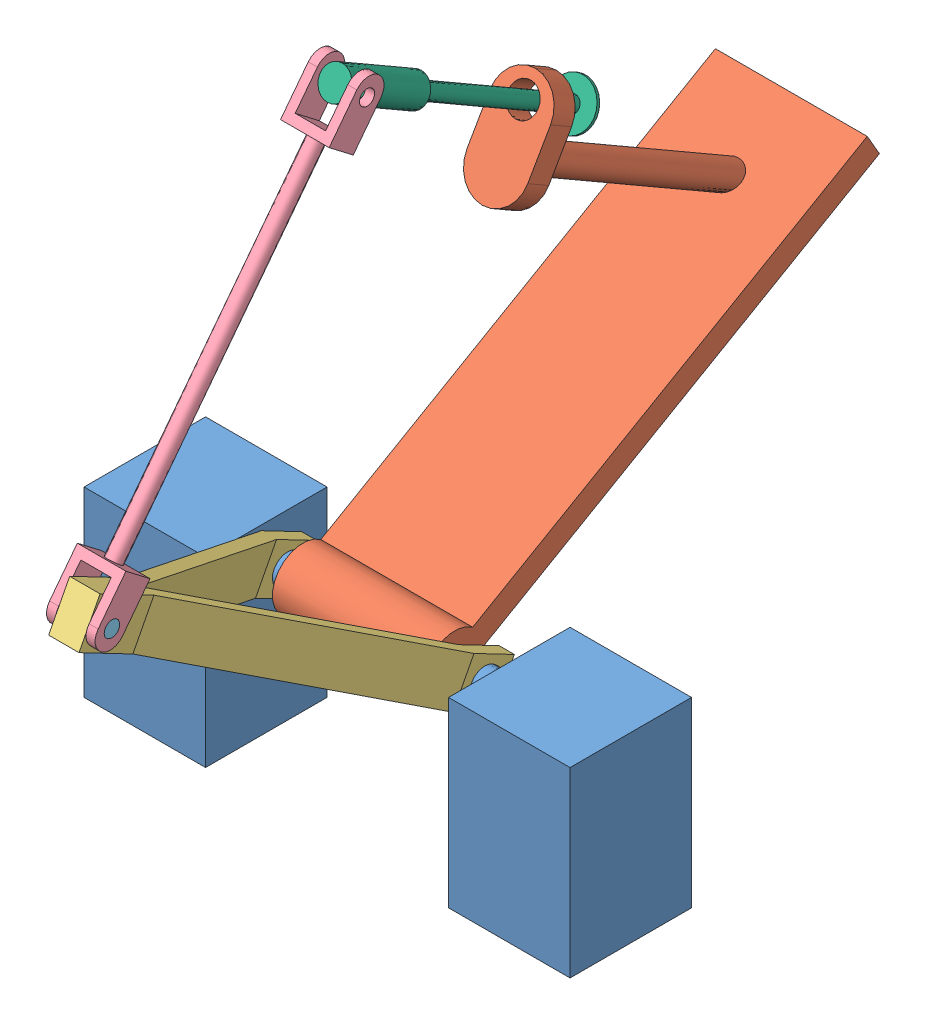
SolidWorks assembly 6.10. Assembl – complete.SLDASM, configuration Default (file format 9000). Lengths in mm.
Overall size (160 229.98 247.36).
7 component instances, 6 part files, 7 mates.
Components (placement in the parent):
- 6.10. Assembly1-1: 6.10. Assembly1.SLDPRT [Default] at origin size (160 60 40)
- 6.10. Assembly2-1: 6.10. Assembly2.SLDPRT [Default] at (-3 65 -25.9808) x (0 0.5 -0.866025) z (1 0 0) size (169.17 98.61 50)
- 6.10. Subassembly-1: 6.10. Subassembly.SLDASM [Default] at (-3 92.9958 82.4643) x (0 -0.462321 -0.886713) z (-1 0 0) size (120.96 151.06 70) (flexible)
  - 6.10. Subassembly1-1: 6.10. Subassembly1.SLDPRT [Default] at origin size (120 15 70)
  - 6.10. Subassembly2-1: 6.10. Subassembly2.SLDPRT [Default] at (-16.034 5.9102 0) x (0.172337 -0.985038 0) z (0 0 1) size (150 10 16)
  - 6.10. Subassembly3-1: 6.10. Subassembly3.SLDPRT [Default] at (-15 0 0) x (0 0 1) z (-0.594351 -0.804206 0) size (16 5.2 5.2)
  - 6.10. Subassembly4-1: 6.10. Subassembly4.SLDPRT [Default] at (5.7853 -136.0642 0) x (0.042975 -0.999076 0) z (0 0 1) size (15 91 15)
Mates (geometry in assembly coordinates):
- Concentric1: concentric anti-aligned: cylinder of 6.10. Assembly1-1 through (-500000 50 0) axis (1 0 0) radius 5; cylinder of 6.10. Assembly2-1 through (22 50 0) axis (-1 0 0) radius 5
- Width1: width = 12 mm anti-aligned: plane of 6.10. Assembly1-1 through (-40 60 20) normal (1 0 0); plane of 6.10. Assembly1-1 through (40 60 20) normal (-1 0 0); plane of 6.10. Assembly2-1 through (-28 65 -25.9808) normal (-1 0 0); plane of 6.10. Assembly2-1 through (22 65 -25.9808) normal (1 0 0)
- Concentric2: concentric anti-aligned: cylinder of 6.10. Assembly1-1 through (-500000 50 0) axis (1 0 0) radius 5; cylinder of 6.10. Subassembly-1/6.10. Subassembly1-1 through (32 50 0) axis (-1 0 0) radius 5
- Width2: width anti-aligned: plane of 6.10. Subassembly-1/6.10. Subassembly1-1 through (-33 86.3455 85.9317) normal (1 0 0); plane of 6.10. Subassembly-1/6.10. Subassembly1-1 through (27 86.3455 85.9317) normal (-1 0 0); plane of 6.10. Assembly2-1 through (-28 65 -25.9808) normal (-1 0 0); plane of 6.10. Assembly2-1 through (22 65 -25.9808) normal (1 0 0)
- Concentric3: concentric aligned: cylinder of 6.10. Assembly2-1 through (-3 120.3582 -142.5169) axis (0 0.5 0.866025) radius 5; cylinder of 6.10. Subassembly-1/6.10. Subassembly4-1 through (-3 165.971 -63.5131) axis (0 0.5 0.866025) radius 2.5
- Width3: width = 41.6 mm anti-aligned: plane of 6.10. Subassembly-1/6.10. Subassembly4-1 through (-3 195.971 -11.5516) normal (0 -0.5 -0.866025); plane of 6.10. Subassembly-1/6.10. Subassembly4-1 through (-3 165.971 -63.5131) normal (0 0.5 0.866025); plane of 6.10. Assembly2-1 through (7 151.7883 -34.0783) normal (0 0.5 0.866025); plane of 6.10. Assembly2-1 through (7 159.0467 -47.5065) normal (0 -0.5 -0.866025)
- Angle2: planar angle = 0.523599 rad aligned: plane of 6.10. Assembly1-1 through (0 60 0) normal (0 1 0); plane of 6.10. Assembly2-1 through (22 68.4641 -23.9808) normal (0 0.866025 0.5)
